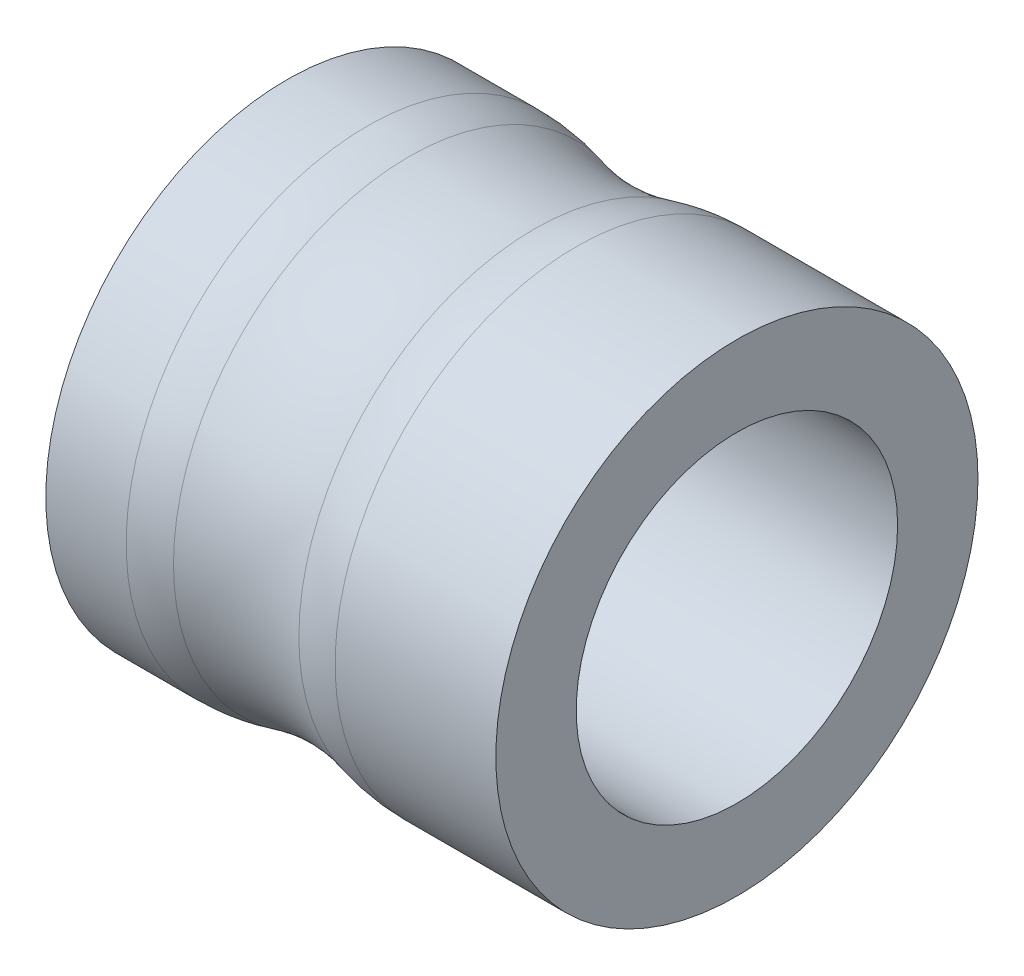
from build123d import *


with BuildPart() as part:
    # Sketch1 → Revolve1 (revolve)
    with BuildSketch(Plane.XY, mode=Mode.PRIVATE) as revolve1_sk:
        with BuildLine():
            Line((0, 2), (5.6, 2))
            Line((5.6, 2), (5.6, 3))
            Line((5.6, 3), (3.6, 3))
            ThreePointArc((3.6, 3), (3.337735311, 2.982729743), (3.08, 2.931217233))
            ThreePointArc((3.08, 2.931217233), (2.3, 2.828043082), (1.52, 2.931217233))
            ThreePointArc((1.52, 2.931217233), (1.262264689, 2.982729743), (1, 3))
            Line((1, 3), (0, 3))
            Line((0, 3), (0, 2))
        make_face()
    revolve(revolve1_sk.sketch.rotate(Axis((5.88, 0, 0), (-1, 0, 0)), 90), axis=Axis((5.88, 0, 0), (-1, 0, 0)))


solid = part.part
